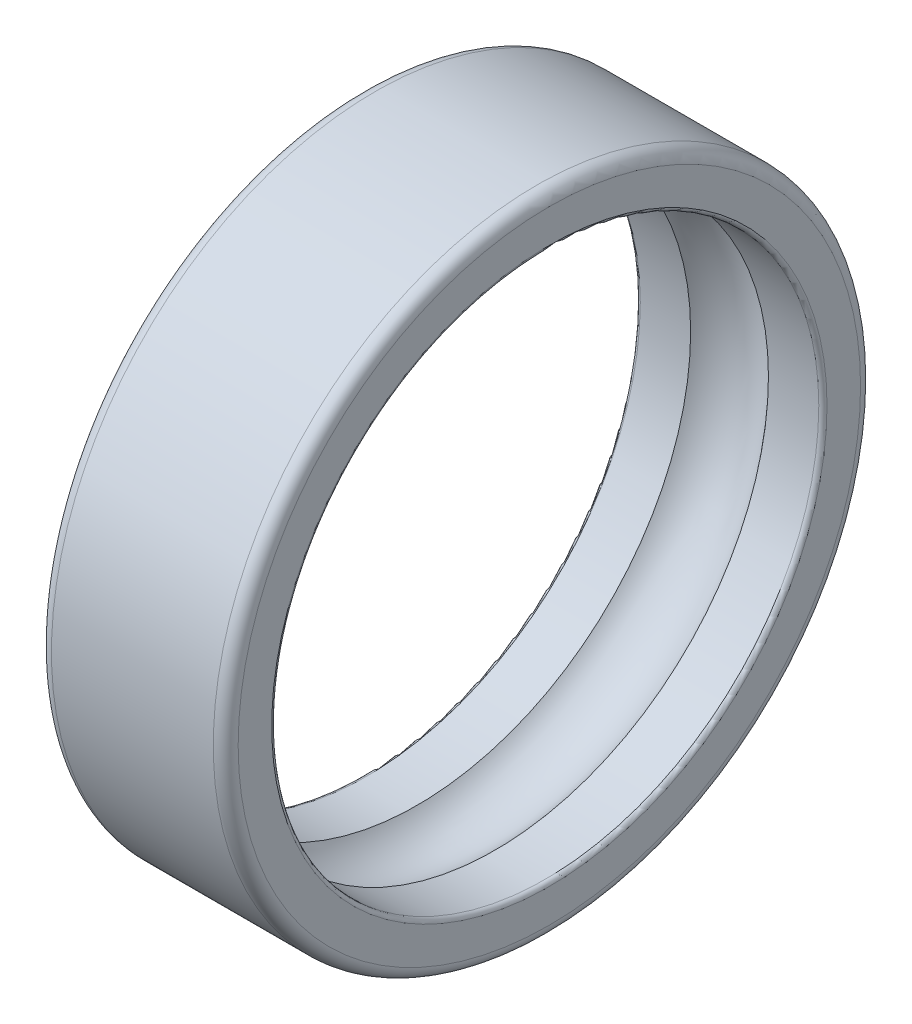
from build123d import *


with BuildPart() as part:
    # Skica1 → Rotovat1 (revolve)
    with BuildSketch(Plane.XY, mode=Mode.PRIVATE) as rotovat1_sk:
        with BuildLine():
            Line((15, 22.305), (15, 25))
            ThreePointArc((15, 25), (14.707106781, 25.707106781), (14, 26))
            Line((14, 26), (1, 26))
            ThreePointArc((1, 26), (0.292893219, 25.707106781), (0, 25))
            Line((0, 25), (0, 22.305))
            ThreePointArc((0, 22.305), (0.096654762, 22.071654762), (0.33, 21.975))
            Line((0.33, 21.975), (4.375, 21.975))
            ThreePointArc((4.375, 21.975), (7.5, 23.497096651), (10.625, 21.975))
            Line((10.625, 21.975), (14.67, 21.975))
            ThreePointArc((14.67, 21.975), (14.903345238, 22.071654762), (15, 22.305))
        make_face()
    revolve(rotovat1_sk.sketch.rotate(Axis((91.436357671, 0, 0), (-1, 0, 0)), 90), axis=Axis((91.436357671, 0, 0), (-1, 0, 0)))


solid = part.part
